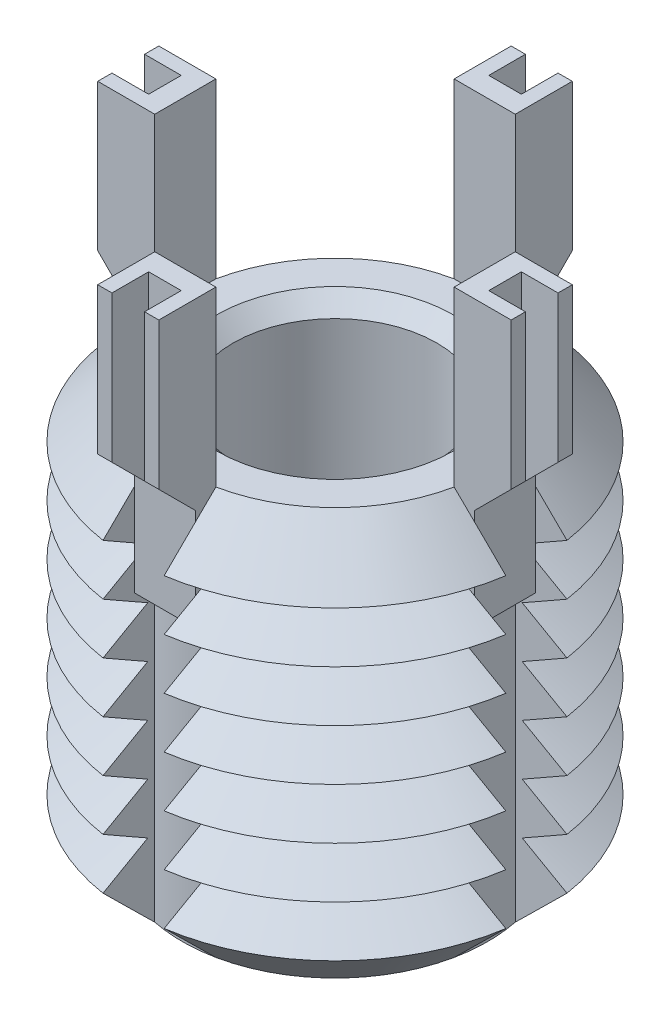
from build123d import *

# Parameters (mm, degrees)
SKETCH1_R               = 5
BOSS_EXTRUDE1_DEPTH     = 10
CHAMFER1_SIZE           = 1.25
LPATTERN1_COUNT         = 6
LPATTERN1_PITCH         = 1.25
CUT_EXTRUDE1_REACH      = 14.247
CIRPATTERN1_COUNT       = 4
BOSS_EXTRUDE3_DEPTH     = 0.75
CIRPATTERN2_COUNT       = 4
CUT_EXTRUDE3_DEPTH      = 16.954880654
CUT_EXTRUDE3_DEPTH_BACK = 16.954880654
SKETCH6_W               = 0.9
SKETCH6_H               = 0.8
SKETCH6_W_2             = 0.8
SKETCH6_H_2             = 0.9
SKETCH7_R               = 2.5
CUT_EXTRUDE4_DEPTH      = 10
CHAMFER2_SIZE           = 0.4


with BuildPart() as part:
    # Sketch1 → Boss-Extrude1 (new body)
    with BuildSketch(Plane(origin=(0, 0, 0), x_dir=(1, 0, 0), z_dir=(0, 1, 0))):
        with Locations(Location((0, 0, 0), (0, 0, 270))):
            Circle(SKETCH1_R)
    extrude(amount=-BOSS_EXTRUDE1_DEPTH)

    # Chamfer1
    chamfer1_edges = [part.edges().sort_by_distance(p)[0] for p in [
        (0, 0, -5),
        (0, -10, -5),
    ]]
    chamfer(chamfer1_edges, length=CHAMFER1_SIZE)

    # Sketch3 → Cut-Revolve1 (revolve, cut)
    with BuildSketch(Plane(origin=(0, 0, 0), x_dir=(0, 0, -1), z_dir=(1, 0, 0))):
        Polygon((-5, -1.25), (-3.917468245, -1.875), (-5, -2.5), align=None)
    cut_revolve1 = revolve(axis=Axis((0, 0.885892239, 0), (0, -1, 0)), mode=Mode.SUBTRACT)

    # LPattern1: Cut-Revolve1 ×6
    with Locations(*[(0, -i * LPATTERN1_PITCH, 0) for i in range(1, LPATTERN1_COUNT)]):
        add(cut_revolve1, mode=Mode.SUBTRACT)

    # Cut-Extrude1: up to this cone (the profile starts inside it)
    cut_extrude1_end = Plane(origin=(0, 0, 0), z_dir=(0, 1, 0)).offset(-13.749999) * Cone(1e-06, 42.247, 42.246999, align=(Align.CENTER, Align.CENTER, Align.MIN), mode=Mode.PRIVATE)
    # Sketch4 → Cut-Extrude1 (cut, up to the surface)
    with BuildSketch(Plane(origin=(0, 0, 0), x_dir=(1, 0, 0), z_dir=(0, 1, 0)), mode=Mode.PRIVATE) as cut_extrude1_sk1:
        with BuildLine():
            Line((-3.674234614, 0.75), (-4.943429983, 0.75))
            ThreePointArc((-4.943429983, 0.75), (-5, 0), (-4.943429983, -0.75))
            Line((-4.943429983, -0.75), (-3.674234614, -0.75))
            ThreePointArc((-3.674234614, -0.75), (-3.75, 0), (-3.674234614, 0.75))
        make_face()
    cut_extrude1_tool1 = extrude(cut_extrude1_sk1.sketch, amount=-CUT_EXTRUDE1_REACH, mode=Mode.PRIVATE) & cut_extrude1_end
    cut_extrude1 = cut_extrude1_tool1.solids().sort_by_distance((-4.352928, 0, 0))[0]
    add(cut_extrude1, mode=Mode.SUBTRACT)

    # CirPattern1: Cut-Extrude1 ×4 about axis
    cirpattern1_axis = Axis((0, 0, 0), (0, 1, 0))
    for i in range(1, CIRPATTERN1_COUNT):
        add(cut_extrude1.rotate(cirpattern1_axis, i * 360 / CIRPATTERN1_COUNT), mode=Mode.SUBTRACT)

    # Sketch5 → Boss-Extrude3 (add, symmetric)
    with BuildSketch(Plane(origin=(0, 0, 0), x_dir=(0, 0, -1), z_dir=(1, 0, 0))):
        Polygon((-3.674234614, 4.25), (-3.674234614, -2.75), (-4.174234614, -2.75), (-4.174234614, -0.25), (-5.074234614, 0.65), (-5.074234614, 4.25), align=None)
    boss_extrude3 = extrude(amount=BOSS_EXTRUDE3_DEPTH, both=True)

    # CirPattern2: Boss-Extrude3 ×4 about axis
    cirpattern2_axis = Axis((0, 0, 0), (0, 1, 0))
    for i in range(1, CIRPATTERN2_COUNT):
        add(boss_extrude3.rotate(cirpattern2_axis, i * 360 / CIRPATTERN2_COUNT))

    # Sketch6 → Cut-Extrude3 (cut, two sides: drawn at the far end of the back side and taken through both)
    with BuildSketch(Plane(origin=(0, 4.25, 0), x_dir=(1, 0, 0), z_dir=(0, 1, 0)).offset(-CUT_EXTRUDE3_DEPTH_BACK)):
        with Locations((-4.624234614, 0)):
            Rectangle(SKETCH6_W, SKETCH6_H)
        with Locations((0, 4.624234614)):
            Rectangle(SKETCH6_W_2, SKETCH6_H_2)
        with Locations((4.624234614, 0)):
            Rectangle(SKETCH6_W, SKETCH6_H)
        with Locations((0, -4.624234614)):
            Rectangle(SKETCH6_W_2, SKETCH6_H_2)
    extrude(amount=CUT_EXTRUDE3_DEPTH + CUT_EXTRUDE3_DEPTH_BACK, mode=Mode.SUBTRACT)

    # Sketch7 → Cut-Extrude4 (cut)
    with BuildSketch(Plane(origin=(0, 0, 0), x_dir=(1, 0, 0), z_dir=(0, 1, 0))):
        with Locations(Location((0, 0, 0), (0, 0, 270))):
            Circle(SKETCH7_R)
    extrude(amount=-CUT_EXTRUDE4_DEPTH, mode=Mode.SUBTRACT)

    # Chamfer2
    chamfer2_edges = [part.edges().sort_by_distance(p)[0] for p in [
        (0, 0, -2.5),
        (0, -10, -2.5),
    ]]
    chamfer(chamfer2_edges, length=CHAMFER2_SIZE)


solid = part.part
